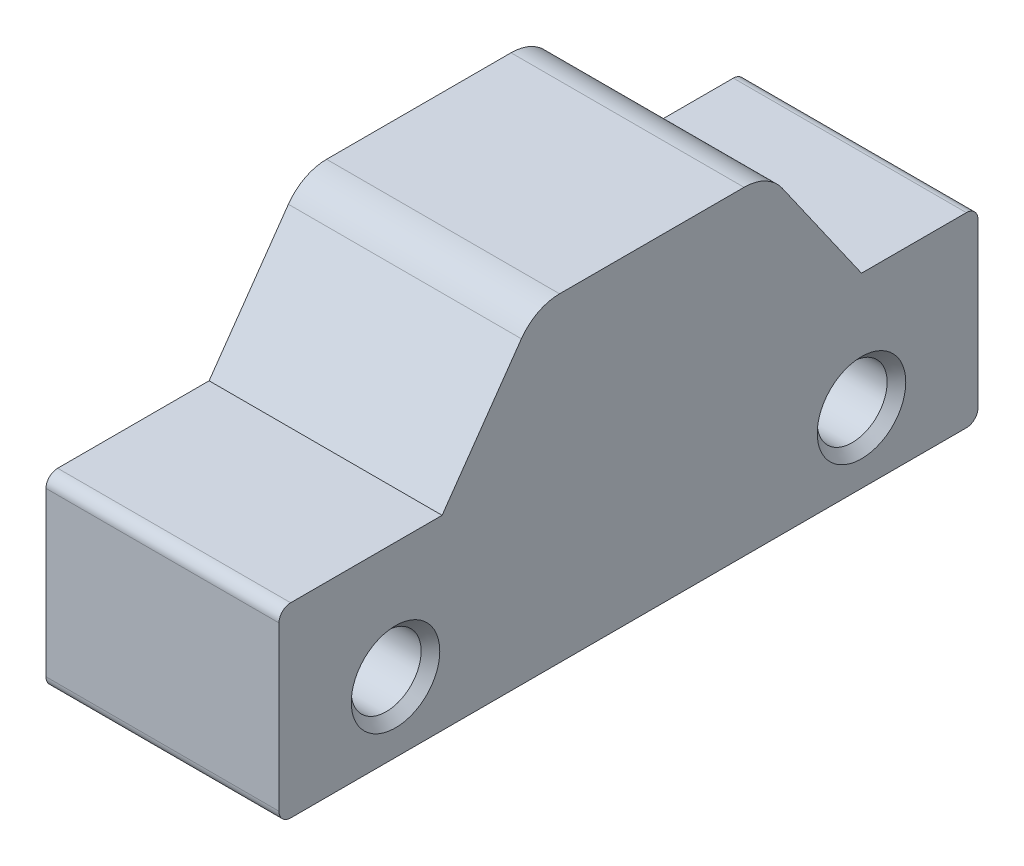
from build123d import *

# Parameters (mm, degrees)
BOSS_EXTRUDE1_DEPTH        = 25
SKETCH3_R                  = 7.5
CUT_EXTRUDE1_DEPTH         = 114.251399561
CHAMFER1_SIZE              = 2
LPATTERN1_COUNT            = 2
LPATTERN1_PITCH            = 100
CHAMFER1_OF_LPATTERN1_SIZE = 2
FILLET1_R                  = 10
FILLET2_R                  = 2.5


with BuildPart() as part:
    # Sketch2 → Boss-Extrude1 (new, symmetric)
    with BuildSketch(Plane(origin=(0, 0, 0), x_dir=(0, 0, -1), z_dir=(1, 0, 0))):
        Polygon((-75, 0), (75, 0), (75, 40), (50, 40), (30, 68.562960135), (-20, 68.562960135), (-40, 40), (-75, 40), align=None)
    extrude(amount=BOSS_EXTRUDE1_DEPTH, both=True)

    # Sketch3 → Cut-Extrude1 (cut, through all)
    with BuildSketch(Plane(origin=(25, 0, 0), x_dir=(0, 0, -1), z_dir=(1, 0, 0))):
        with Locations((-50, 15)):
            Circle(SKETCH3_R)
    cut_extrude1 = extrude(amount=-CUT_EXTRUDE1_DEPTH, mode=Mode.SUBTRACT)

    # Chamfer1
    chamfer1_edges = [part.edges().sort_by_distance(p)[0] for p in [
        (-25, 15, 57.5),
        (25, 15, 57.5),
    ]]
    chamfer(chamfer1_edges, length=CHAMFER1_SIZE)

    # LPattern1: Cut-Extrude1 ×2
    with Locations(*[(0, 0, -i * LPATTERN1_PITCH) for i in range(1, LPATTERN1_COUNT)]):
        add(cut_extrude1, mode=Mode.SUBTRACT)

    # Chamfer1 of LPattern1
    chamfer1_of_lpattern1_edges = [part.edges().sort_by_distance(p)[0] for p in [
        (-25, 15, -42.5),
        (25, 15, -42.5),
    ]]
    chamfer(chamfer1_of_lpattern1_edges, length=CHAMFER1_OF_LPATTERN1_SIZE)

    # Fillet1
    fillet1_edges = [part.edges().sort_by_distance(p)[0] for p in [
        (0, 68.562960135, 20),
        (0, 68.562960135, -30),
    ]]
    fillet(fillet1_edges, radius=FILLET1_R)

    # Fillet2
    fillet2_edges = [part.edges().sort_by_distance(p)[0] for p in [
        (0, 40, -75),
        (0, 0, -75),
        (0, 0, 75),
        (0, 40, 75),
    ]]
    fillet(fillet2_edges, radius=FILLET2_R)


solid = part.part
